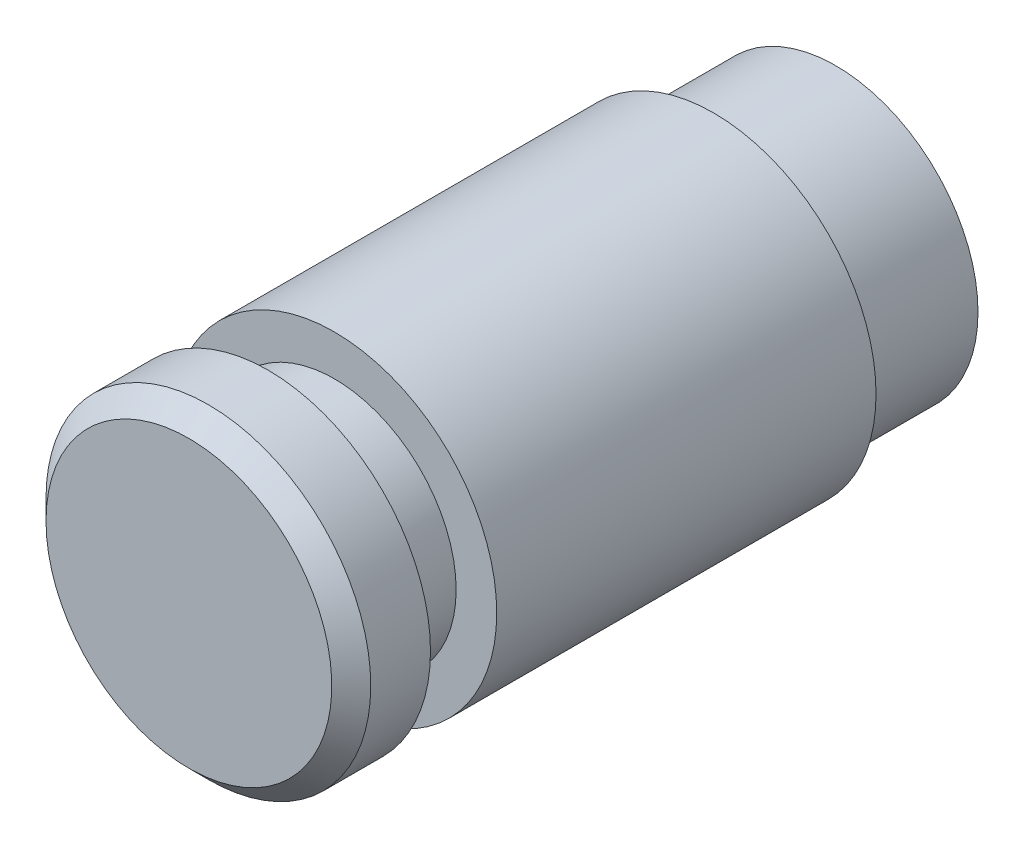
from build123d import *

# Parameters (mm, degrees)
SKETCH1_R           = 2.7813
BOSS_EXTRUDE1_DEPTH = 2.3876
SKETCH2_R           = 3.175
BOSS_EXTRUDE2_DEPTH = 10.2616
CHAMFER1_SIZE       = 0.381
SKETCH3_W           = 1.2954
SKETCH3_H           = 0.79375


with BuildPart() as part:
    # Sketch1 → Boss-Extrude1 (new body)
    with BuildSketch(Plane.XY):
        Circle(SKETCH1_R)
    extrude(amount=-BOSS_EXTRUDE1_DEPTH)

    # Sketch2 → Boss-Extrude2 (add)
    with BuildSketch(Plane.XY):
        Circle(SKETCH2_R)
    extrude(amount=BOSS_EXTRUDE2_DEPTH)

    # Chamfer1
    chamfer1_edges = [part.edges().sort_by_distance(p)[0] for p in [
        (-3.175, 0, 10.2616),
    ]]
    chamfer(chamfer1_edges, length=CHAMFER1_SIZE)

    # Sketch3 → Cut-Revolve1 (revolve, cut)
    with BuildSketch(Plane(origin=(0, 0, 0), x_dir=(0, 0, -1), z_dir=(1, 0, 0)), mode=Mode.PRIVATE) as cut_revolve1_sk:
        with Locations((-8.0645, 2.778125)):
            Rectangle(SKETCH3_W, SKETCH3_H)
    revolve(cut_revolve1_sk.sketch.rotate(Axis((0, 0, 0), (0, 0, 1)), 90), axis=Axis((0, 0, 0), (0, 0, 1)), mode=Mode.SUBTRACT)


solid = part.part
